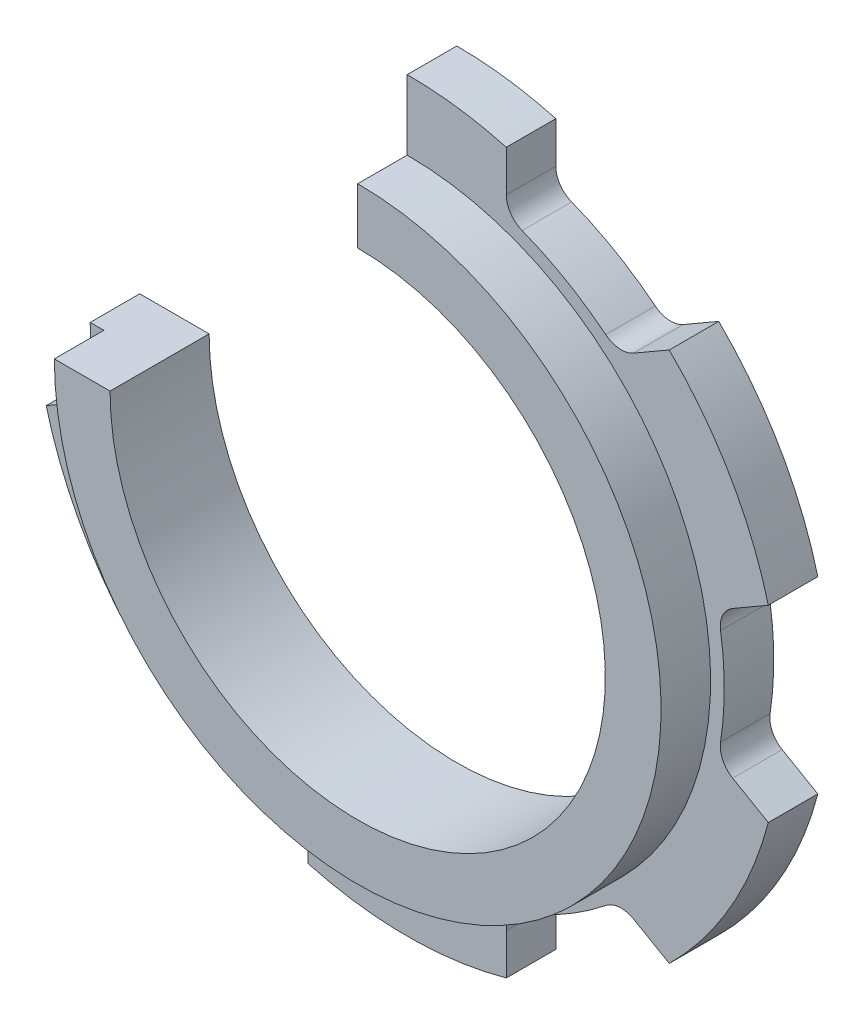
ISO-10303-21;
HEADER;
FILE_DESCRIPTION(('STEP AP214'),'2;1');
FILE_NAME('part.step','',(''),(''),'','','');
FILE_SCHEMA(('AUTOMOTIVE_DESIGN { 1 0 10303 214 1 1 1 1 }'));
ENDSEC;
DATA;
#1=APPLICATION_CONTEXT('core data for automotive mechanical design processes');
#2=APPLICATION_PROTOCOL_DEFINITION('international standard','automotive_design',2000,#1);
#3=PRODUCT_CONTEXT('',#1,'mechanical');
#4=PRODUCT('Part','Part','',(#3));
#5=PRODUCT_RELATED_PRODUCT_CATEGORY('part','',(#4));
#6=PRODUCT_DEFINITION_FORMATION('','',#4);
#7=PRODUCT_DEFINITION_CONTEXT('part definition',#1,'design');
#8=PRODUCT_DEFINITION('design','',#6,#7);
#9=PRODUCT_DEFINITION_SHAPE('','',#8);
#10=(LENGTH_UNIT() NAMED_UNIT(*) SI_UNIT(.MILLI.,.METRE.));
#11=(NAMED_UNIT(*) PLANE_ANGLE_UNIT() SI_UNIT($,.RADIAN.));
#12=(NAMED_UNIT(*) SI_UNIT($,.STERADIAN.) SOLID_ANGLE_UNIT());
#13=UNCERTAINTY_MEASURE_WITH_UNIT(LENGTH_MEASURE(1.E-05),#10,'distance_accuracy_value','');
#14=(GEOMETRIC_REPRESENTATION_CONTEXT(3) GLOBAL_UNCERTAINTY_ASSIGNED_CONTEXT((#13)) GLOBAL_UNIT_ASSIGNED_CONTEXT((#10,
#11,#12)) REPRESENTATION_CONTEXT('',''));
#15=CARTESIAN_POINT('',(0.,0.,0.));
#16=DIRECTION('',(0.,0.,1.));
#17=DIRECTION('',(1.,0.,0.));
#18=AXIS2_PLACEMENT_3D('',#15,#16,#17);
#19=CARTESIAN_POINT('',(0.,0.,-2.));
#20=DIRECTION('',(0.,0.,1.));
#21=DIRECTION('',(1.,0.,0.));
#22=AXIS2_PLACEMENT_3D('',#19,#20,#21);
#23=CYLINDRICAL_SURFACE('',#22,15.0665917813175);
#24=DIRECTION('',(0.,0.,1.));
#25=VECTOR('',#24,1.);
#26=CARTESIAN_POINT('',(0.,15.0665917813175,-2.));
#27=LINE('',#26,#25);
#28=CARTESIAN_POINT('',(0.,15.0665917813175,0.));
#29=VERTEX_POINT('',#28);
#30=CARTESIAN_POINT('',(0.,15.0665917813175,-2.));
#31=VERTEX_POINT('',#30);
#32=EDGE_CURVE('E11',#29,#31,#27,.F.);
#33=ORIENTED_EDGE('',*,*,#32,.F.);
#34=CARTESIAN_POINT('',(0.,0.,0.));
#35=DIRECTION('',(0.,0.,-1.));
#36=DIRECTION('',(-1.,0.,0.));
#37=AXIS2_PLACEMENT_3D('',#34,#35,#36);
#38=CIRCLE('',#37,15.0665917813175);
#39=CARTESIAN_POINT('',(4.,14.52591435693,0.));
#40=VERTEX_POINT('',#39);
#41=EDGE_CURVE('E451',#29,#40,#38,.T.);
#42=ORIENTED_EDGE('',*,*,#41,.T.);
#43=DIRECTION('',(0.,0.,1.));
#44=VECTOR('',#43,1.);
#45=CARTESIAN_POINT('',(4.,14.52591435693,-2.));
#46=LINE('',#45,#44);
#47=CARTESIAN_POINT('',(4.,14.52591435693,-2.));
#48=VERTEX_POINT('',#47);
#49=EDGE_CURVE('E341',#48,#40,#46,.T.);
#50=ORIENTED_EDGE('',*,*,#49,.F.);
#51=CARTESIAN_POINT('',(0.,0.,-2.));
#52=DIRECTION('',(0.,0.,-1.));
#53=DIRECTION('',(-1.,0.,0.));
#54=AXIS2_PLACEMENT_3D('',#51,#52,#53);
#55=CIRCLE('',#54,15.0665917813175);
#56=EDGE_CURVE('E263',#31,#48,#55,.T.);
#57=ORIENTED_EDGE('',*,*,#56,.F.);
#58=EDGE_LOOP('',(#33,#42,#50,#57));
#59=FACE_BOUND('',#58,.T.);
#60=ADVANCED_FACE('F30',(#59),#23,.T.);
#61=CARTESIAN_POINT('',(0.,0.,2.));
#62=DIRECTION('',(0.,0.,1.));
#63=DIRECTION('',(1.,0.,0.));
#64=AXIS2_PLACEMENT_3D('',#61,#62,#63);
#65=PLANE('',#64);
#66=DIRECTION('',(1.,0.,0.));
#67=VECTOR('',#66,1.);
#68=CARTESIAN_POINT('',(0.,0.,2.));
#69=LINE('',#68,#67);
#70=CARTESIAN_POINT('',(-12.25,0.,2.));
#71=VERTEX_POINT('',#70);
#72=CARTESIAN_POINT('',(-10.,0.,2.));
#73=VERTEX_POINT('',#72);
#74=EDGE_CURVE('E559',#71,#73,#69,.T.);
#75=ORIENTED_EDGE('',*,*,#74,.F.);
#76=CARTESIAN_POINT('',(0.,0.,2.));
#77=DIRECTION('',(0.,0.,1.));
#78=DIRECTION('',(1.,0.,0.));
#79=AXIS2_PLACEMENT_3D('',#76,#77,#78);
#80=CIRCLE('',#79,12.25);
#81=CARTESIAN_POINT('',(0.,12.25,2.));
#82=VERTEX_POINT('',#81);
#83=EDGE_CURVE('E348',#71,#82,#80,.T.);
#84=ORIENTED_EDGE('',*,*,#83,.T.);
#85=DIRECTION('',(0.,-1.,0.));
#86=VECTOR('',#85,1.);
#87=CARTESIAN_POINT('',(0.,0.,2.));
#88=LINE('',#87,#86);
#89=CARTESIAN_POINT('',(0.,10.,2.));
#90=VERTEX_POINT('',#89);
#91=EDGE_CURVE('E561',#82,#90,#88,.T.);
#92=ORIENTED_EDGE('',*,*,#91,.T.);
#93=CARTESIAN_POINT('',(0.,0.,2.));
#94=DIRECTION('',(0.,0.,1.));
#95=DIRECTION('',(1.,0.,0.));
#96=AXIS2_PLACEMENT_3D('',#93,#94,#95);
#97=CIRCLE('',#96,10.);
#98=EDGE_CURVE('E345',#73,#90,#97,.T.);
#99=ORIENTED_EDGE('',*,*,#98,.F.);
#100=EDGE_LOOP('',(#75,#84,#92,#99));
#101=FACE_BOUND('',#100,.T.);
#102=ADVANCED_FACE('F531',(#101),#65,.T.);
#103=CARTESIAN_POINT('',(0.,0.,2.));
#104=DIRECTION('',(0.,0.,-1.));
#105=DIRECTION('',(-1.,0.,0.));
#106=AXIS2_PLACEMENT_3D('',#103,#104,#105);
#107=CYLINDRICAL_SURFACE('',#106,12.25);
#108=ORIENTED_EDGE('',*,*,#83,.F.);
#109=DIRECTION('',(0.,0.,-1.));
#110=VECTOR('',#109,1.);
#111=CARTESIAN_POINT('',(-12.25,0.,2.));
#112=LINE('',#111,#110);
#113=CARTESIAN_POINT('',(-12.25,0.,0.));
#114=VERTEX_POINT('',#113);
#115=EDGE_CURVE('E555',#71,#114,#112,.T.);
#116=ORIENTED_EDGE('',*,*,#115,.T.);
#117=CARTESIAN_POINT('',(0.,0.,0.));
#118=DIRECTION('',(0.,0.,-1.));
#119=DIRECTION('',(-1.,0.,0.));
#120=AXIS2_PLACEMENT_3D('',#117,#118,#119);
#121=CIRCLE('',#120,12.25);
#122=CARTESIAN_POINT('',(0.,12.25,0.));
#123=VERTEX_POINT('',#122);
#124=EDGE_CURVE('E256',#123,#114,#121,.T.);
#125=ORIENTED_EDGE('',*,*,#124,.F.);
#126=DIRECTION('',(0.,0.,-1.));
#127=VECTOR('',#126,1.);
#128=CARTESIAN_POINT('',(0.,12.25,2.));
#129=LINE('',#128,#127);
#130=EDGE_CURVE('E563',#82,#123,#129,.T.);
#131=ORIENTED_EDGE('',*,*,#130,.F.);
#132=EDGE_LOOP('',(#108,#116,#125,#131));
#133=FACE_BOUND('',#132,.T.);
#134=ADVANCED_FACE('F32',(#133),#107,.T.);
#135=CARTESIAN_POINT('',(0.,0.,2.));
#136=DIRECTION('',(0.,0.,-1.));
#137=DIRECTION('',(-1.,0.,0.));
#138=AXIS2_PLACEMENT_3D('',#135,#136,#137);
#139=CYLINDRICAL_SURFACE('',#138,10.);
#140=DIRECTION('',(0.,0.,-1.));
#141=VECTOR('',#140,1.);
#142=CARTESIAN_POINT('',(-10.,0.,2.));
#143=LINE('',#142,#141);
#144=CARTESIAN_POINT('',(-9.99999999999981,0.,-2.));
#145=VERTEX_POINT('',#144);
#146=EDGE_CURVE('E257',#73,#145,#143,.T.);
#147=ORIENTED_EDGE('',*,*,#146,.F.);
#148=ORIENTED_EDGE('',*,*,#98,.T.);
#149=DIRECTION('',(0.,0.,-1.));
#150=VECTOR('',#149,1.);
#151=CARTESIAN_POINT('',(0.,10.,2.));
#152=LINE('',#151,#150);
#153=CARTESIAN_POINT('',(0.,10.0000000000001,-2.));
#154=VERTEX_POINT('',#153);
#155=EDGE_CURVE('E565',#90,#154,#152,.T.);
#156=ORIENTED_EDGE('',*,*,#155,.T.);
#157=CARTESIAN_POINT('',(0.,1.62351801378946E-13,-2.));
#158=DIRECTION('',(0.,0.,-1.));
#159=DIRECTION('',(-1.,0.,0.));
#160=AXIS2_PLACEMENT_3D('',#157,#158,#159);
#161=CIRCLE('',#160,9.9999999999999);
#162=EDGE_CURVE('E455',#154,#145,#161,.T.);
#163=ORIENTED_EDGE('',*,*,#162,.T.);
#164=EDGE_LOOP('',(#147,#148,#156,#163));
#165=FACE_BOUND('',#164,.T.);
#166=ADVANCED_FACE('F541',(#165),#139,.F.);
#167=CARTESIAN_POINT('',(0.,1.62351801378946E-13,0.));
#168=DIRECTION('',(0.,0.,-1.));
#169=DIRECTION('',(-1.,0.,0.));
#170=AXIS2_PLACEMENT_3D('',#167,#168,#169);
#171=PLANE('',#170);
#172=ORIENTED_EDGE('',*,*,#124,.T.);
#173=DIRECTION('',(-1.,0.,0.));
#174=VECTOR('',#173,1.);
#175=CARTESIAN_POINT('',(0.,0.,0.));
#176=LINE('',#175,#174);
#177=CARTESIAN_POINT('',(-12.8023679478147,0.,0.));
#178=VERTEX_POINT('',#177);
#179=EDGE_CURVE('E243',#114,#178,#176,.T.);
#180=ORIENTED_EDGE('',*,*,#179,.T.);
#181=CARTESIAN_POINT('',(0.,1.62351801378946E-13,0.));
#182=DIRECTION('',(0.,0.,-1.));
#183=DIRECTION('',(-1.,0.,0.));
#184=AXIS2_PLACEMENT_3D('',#181,#182,#183);
#185=CIRCLE('',#184,12.8023679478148);
#186=CARTESIAN_POINT('',(-12.6529885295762,-1.95000162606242,0.));
#187=VERTEX_POINT('',#186);
#188=EDGE_CURVE('E254',#187,#178,#185,.T.);
#189=ORIENTED_EDGE('',*,*,#188,.F.);
#190=CARTESIAN_POINT('',(-13.6413204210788,-2.10231732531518,0.));
#191=DIRECTION('',(0.,0.,-1.));
#192=DIRECTION('',(-1.,0.,0.));
#193=AXIS2_PLACEMENT_3D('',#190,#191,#192);
#194=CIRCLE('',#193,1.);
#195=CARTESIAN_POINT('',(-13.1413204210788,-2.96834272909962,0.));
#196=VERTEX_POINT('',#195);
#197=EDGE_CURVE('E414',#187,#196,#194,.T.);
#198=ORIENTED_EDGE('',*,*,#197,.T.);
#199=DIRECTION('',(0.866025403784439,0.5,0.));
#200=VECTOR('',#199,1.);
#201=CARTESIAN_POINT('',(-14.5798108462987,-3.79885556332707,0.));
#202=LINE('',#201,#200);
#203=CARTESIAN_POINT('',(-14.5798108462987,-3.79885556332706,0.));
#204=VERTEX_POINT('',#203);
#205=EDGE_CURVE('E264',#204,#196,#202,.T.);
#206=ORIENTED_EDGE('',*,*,#205,.F.);
#207=CARTESIAN_POINT('',(0.,0.,0.));
#208=DIRECTION('',(0.,0.,-1.));
#209=DIRECTION('',(-1.,0.,0.));
#210=AXIS2_PLACEMENT_3D('',#207,#208,#209);
#211=CIRCLE('',#210,15.0665917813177);
#212=CARTESIAN_POINT('',(-10.5798108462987,-10.7270587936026,0.));
#213=VERTEX_POINT('',#212);
#214=EDGE_CURVE('E269',#213,#204,#211,.T.);
#215=ORIENTED_EDGE('',*,*,#214,.F.);
#216=DIRECTION('',(-0.866025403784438,-0.5,0.));
#217=VECTOR('',#216,1.);
#218=CARTESIAN_POINT('',(-10.5798108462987,-10.7270587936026,0.));
#219=LINE('',#218,#217);
#220=CARTESIAN_POINT('',(-9.14132042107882,-9.89654595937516,0.));
#221=VERTEX_POINT('',#220);
#222=EDGE_CURVE('E488',#221,#213,#219,.T.);
#223=ORIENTED_EDGE('',*,*,#222,.F.);
#224=CARTESIAN_POINT('',(-8.64132042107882,-10.7625713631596,0.));
#225=DIRECTION('',(0.,0.,-1.));
#226=DIRECTION('',(-1.,0.,0.));
#227=AXIS2_PLACEMENT_3D('',#224,#225,#226);
#228=CIRCLE('',#227,1.);
#229=CARTESIAN_POINT('',(-8.0152452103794,-9.9828086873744,0.));
#230=VERTEX_POINT('',#229);
#231=EDGE_CURVE('E406',#221,#230,#228,.T.);
#232=ORIENTED_EDGE('',*,*,#231,.T.);
#233=CARTESIAN_POINT('',(0.,1.62351801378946E-13,0.));
#234=DIRECTION('',(0.,0.,-1.));
#235=DIRECTION('',(-1.,0.,0.));
#236=AXIS2_PLACEMENT_3D('',#233,#234,#235);
#237=CIRCLE('',#236,12.8023679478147);
#238=CARTESIAN_POINT('',(-4.63774331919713,-11.9328103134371,0.));
#239=VERTEX_POINT('',#238);
#240=EDGE_CURVE('E485',#239,#230,#237,.T.);
#241=ORIENTED_EDGE('',*,*,#240,.F.);
#242=CARTESIAN_POINT('',(-5.00000000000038,-12.864888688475,0.));
#243=DIRECTION('',(0.,0.,-1.));
#244=DIRECTION('',(-1.,0.,0.));
#245=AXIS2_PLACEMENT_3D('',#242,#243,#244);
#246=CIRCLE('',#245,1.);
#247=CARTESIAN_POINT('',(-4.00000000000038,-12.864888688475,0.));
#248=VERTEX_POINT('',#247);
#249=EDGE_CURVE('E410',#239,#248,#246,.T.);
#250=ORIENTED_EDGE('',*,*,#249,.T.);
#251=DIRECTION('',(0.,1.,0.));
#252=VECTOR('',#251,1.);
#253=CARTESIAN_POINT('',(-4.00000000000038,-14.52591435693,0.));
#254=LINE('',#253,#252);
#255=CARTESIAN_POINT('',(-4.00000000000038,-14.52591435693,0.));
#256=VERTEX_POINT('',#255);
#257=EDGE_CURVE('E482',#256,#248,#254,.T.);
#258=ORIENTED_EDGE('',*,*,#257,.F.);
#259=CARTESIAN_POINT('',(-3.74935424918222E-13,0.,0.));
#260=DIRECTION('',(0.,0.,-1.));
#261=DIRECTION('',(-1.,0.,0.));
#262=AXIS2_PLACEMENT_3D('',#259,#260,#261);
#263=CIRCLE('',#262,15.0665917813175);
#264=CARTESIAN_POINT('',(3.99999999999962,-14.52591435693,0.));
#265=VERTEX_POINT('',#264);
#266=EDGE_CURVE('E480',#265,#256,#263,.T.);
#267=ORIENTED_EDGE('',*,*,#266,.F.);
#268=DIRECTION('',(0.,-1.,0.));
#269=VECTOR('',#268,1.);
#270=CARTESIAN_POINT('',(3.99999999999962,-14.52591435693,0.));
#271=LINE('',#270,#269);
#272=CARTESIAN_POINT('',(3.99999999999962,-12.8648886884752,0.));
#273=VERTEX_POINT('',#272);
#274=EDGE_CURVE('E478',#273,#265,#271,.T.);
#275=ORIENTED_EDGE('',*,*,#274,.F.);
#276=CARTESIAN_POINT('',(4.99999999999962,-12.8648886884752,0.));
#277=DIRECTION('',(0.,0.,-1.));
#278=DIRECTION('',(-1.,0.,0.));
#279=AXIS2_PLACEMENT_3D('',#276,#277,#278);
#280=CIRCLE('',#279,1.);
#281=CARTESIAN_POINT('',(4.63774331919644,-11.9328103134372,0.));
#282=VERTEX_POINT('',#281);
#283=EDGE_CURVE('E398',#273,#282,#280,.T.);
#284=ORIENTED_EDGE('',*,*,#283,.T.);
#285=CARTESIAN_POINT('',(0.,1.62351801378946E-13,0.));
#286=DIRECTION('',(0.,0.,-1.));
#287=DIRECTION('',(-1.,0.,0.));
#288=AXIS2_PLACEMENT_3D('',#285,#286,#287);
#289=CIRCLE('',#288,12.8023679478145);
#290=CARTESIAN_POINT('',(8.01524521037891,-9.98280868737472,0.));
#291=VERTEX_POINT('',#290);
#292=EDGE_CURVE('E475',#291,#282,#289,.T.);
#293=ORIENTED_EDGE('',*,*,#292,.F.);
#294=CARTESIAN_POINT('',(8.64132042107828,-10.7625713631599,0.));
#295=DIRECTION('',(0.,0.,-1.));
#296=DIRECTION('',(-1.,0.,0.));
#297=AXIS2_PLACEMENT_3D('',#294,#295,#296);
#298=CIRCLE('',#297,1.);
#299=CARTESIAN_POINT('',(9.14132042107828,-9.8965459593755,0.));
#300=VERTEX_POINT('',#299);
#301=EDGE_CURVE('E402',#291,#300,#298,.T.);
#302=ORIENTED_EDGE('',*,*,#301,.T.);
#303=DIRECTION('',(-0.866025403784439,0.499999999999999,0.));
#304=VECTOR('',#303,1.);
#305=CARTESIAN_POINT('',(10.5798108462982,-10.7270587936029,0.));
#306=LINE('',#305,#304);
#307=CARTESIAN_POINT('',(10.5798108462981,-10.7270587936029,0.));
#308=VERTEX_POINT('',#307);
#309=EDGE_CURVE('E472',#308,#300,#306,.T.);
#310=ORIENTED_EDGE('',*,*,#309,.F.);
#311=CARTESIAN_POINT('',(0.,0.,0.));
#312=DIRECTION('',(0.,0.,-1.));
#313=DIRECTION('',(-1.,0.,0.));
#314=AXIS2_PLACEMENT_3D('',#311,#312,#313);
#315=CIRCLE('',#314,15.0665917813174);
#316=CARTESIAN_POINT('',(14.5798108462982,-3.7988555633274,0.));
#317=VERTEX_POINT('',#316);
#318=EDGE_CURVE('E470',#317,#308,#315,.T.);
#319=ORIENTED_EDGE('',*,*,#318,.F.);
#320=DIRECTION('',(0.866025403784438,-0.5,0.));
#321=VECTOR('',#320,1.);
#322=CARTESIAN_POINT('',(14.5798108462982,-3.7988555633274,0.));
#323=LINE('',#322,#321);
#324=CARTESIAN_POINT('',(13.1413204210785,-2.96834272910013,0.));
#325=VERTEX_POINT('',#324);
#326=EDGE_CURVE('E468',#325,#317,#323,.T.);
#327=ORIENTED_EDGE('',*,*,#326,.F.);
#328=CARTESIAN_POINT('',(13.6413204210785,-2.10231732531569,0.));
#329=DIRECTION('',(0.,0.,-1.));
#330=DIRECTION('',(-1.,0.,0.));
#331=AXIS2_PLACEMENT_3D('',#328,#329,#330);
#332=CIRCLE('',#331,1.);
#333=CARTESIAN_POINT('',(12.6529885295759,-1.95000162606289,0.));
#334=VERTEX_POINT('',#333);
#335=EDGE_CURVE('E418',#325,#334,#332,.T.);
#336=ORIENTED_EDGE('',*,*,#335,.T.);
#337=CARTESIAN_POINT('',(0.,1.62351801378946E-13,0.));
#338=DIRECTION('',(0.,0.,-1.));
#339=DIRECTION('',(-1.,0.,0.));
#340=AXIS2_PLACEMENT_3D('',#337,#338,#339);
#341=CIRCLE('',#340,12.8023679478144);
#342=CARTESIAN_POINT('',(12.652988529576,1.95000162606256,0.));
#343=VERTEX_POINT('',#342);
#344=EDGE_CURVE('E465',#343,#334,#341,.T.);
#345=ORIENTED_EDGE('',*,*,#344,.F.);
#346=CARTESIAN_POINT('',(13.6413204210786,2.10231732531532,0.));
#347=DIRECTION('',(0.,0.,-1.));
#348=DIRECTION('',(-1.,0.,0.));
#349=AXIS2_PLACEMENT_3D('',#346,#347,#348);
#350=CIRCLE('',#349,1.);
#351=CARTESIAN_POINT('',(13.1413204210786,2.96834272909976,0.));
#352=VERTEX_POINT('',#351);
#353=EDGE_CURVE('E394',#343,#352,#350,.T.);
#354=ORIENTED_EDGE('',*,*,#353,.T.);
#355=DIRECTION('',(-0.86602540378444,-0.499999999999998,0.));
#356=VECTOR('',#355,1.);
#357=CARTESIAN_POINT('',(14.5798108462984,3.79885556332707,0.));
#358=LINE('',#357,#356);
#359=CARTESIAN_POINT('',(14.5798108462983,3.79885556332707,0.));
#360=VERTEX_POINT('',#359);
#361=EDGE_CURVE('E462',#360,#352,#358,.T.);
#362=ORIENTED_EDGE('',*,*,#361,.F.);
#363=CARTESIAN_POINT('',(0.,0.,0.));
#364=DIRECTION('',(0.,0.,-1.));
#365=DIRECTION('',(-1.,0.,0.));
#366=AXIS2_PLACEMENT_3D('',#363,#364,#365);
#367=CIRCLE('',#366,15.0665917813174);
#368=CARTESIAN_POINT('',(10.5798108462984,10.7270587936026,0.));
#369=VERTEX_POINT('',#368);
#370=EDGE_CURVE('E460',#369,#360,#367,.T.);
#371=ORIENTED_EDGE('',*,*,#370,.F.);
#372=DIRECTION('',(0.866025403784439,0.5,0.));
#373=VECTOR('',#372,1.);
#374=CARTESIAN_POINT('',(10.5798108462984,10.7270587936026,0.));
#375=LINE('',#374,#373);
#376=CARTESIAN_POINT('',(9.14132042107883,9.89654595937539,0.));
#377=VERTEX_POINT('',#376);
#378=EDGE_CURVE('E453',#377,#369,#375,.T.);
#379=ORIENTED_EDGE('',*,*,#378,.F.);
#380=CARTESIAN_POINT('',(8.64132042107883,10.7625713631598,0.));
#381=DIRECTION('',(0.,0.,-1.));
#382=DIRECTION('',(-1.,0.,0.));
#383=AXIS2_PLACEMENT_3D('',#380,#381,#382);
#384=CIRCLE('',#383,1.);
#385=CARTESIAN_POINT('',(8.01524521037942,9.98280868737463,0.));
#386=VERTEX_POINT('',#385);
#387=EDGE_CURVE('E422',#377,#386,#384,.T.);
#388=ORIENTED_EDGE('',*,*,#387,.T.);
#389=CARTESIAN_POINT('',(0.,1.62351801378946E-13,0.));
#390=DIRECTION('',(0.,0.,-1.));
#391=DIRECTION('',(-1.,0.,0.));
#392=AXIS2_PLACEMENT_3D('',#389,#390,#391);
#393=CIRCLE('',#392,12.8023679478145);
#394=CARTESIAN_POINT('',(4.63774331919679,11.9328103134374,0.));
#395=VERTEX_POINT('',#394);
#396=EDGE_CURVE('E447',#395,#386,#393,.T.);
#397=ORIENTED_EDGE('',*,*,#396,.F.);
#398=CARTESIAN_POINT('',(5.,12.8648886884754,0.));
#399=DIRECTION('',(0.,0.,-1.));
#400=DIRECTION('',(-1.,0.,0.));
#401=AXIS2_PLACEMENT_3D('',#398,#399,#400);
#402=CIRCLE('',#401,1.);
#403=CARTESIAN_POINT('',(4.,12.8648886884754,0.));
#404=VERTEX_POINT('',#403);
#405=EDGE_CURVE('E426',#395,#404,#402,.T.);
#406=ORIENTED_EDGE('',*,*,#405,.T.);
#407=DIRECTION('',(0.,-1.,0.));
#408=VECTOR('',#407,1.);
#409=CARTESIAN_POINT('',(4.,14.52591435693,0.));
#410=LINE('',#409,#408);
#411=EDGE_CURVE('E446',#40,#404,#410,.T.);
#412=ORIENTED_EDGE('',*,*,#411,.F.);
#413=ORIENTED_EDGE('',*,*,#41,.F.);
#414=DIRECTION('',(0.,1.,0.));
#415=VECTOR('',#414,1.);
#416=CARTESIAN_POINT('',(0.,1.62351801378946E-13,0.));
#417=LINE('',#416,#415);
#418=EDGE_CURVE('E44',#123,#29,#417,.T.);
#419=ORIENTED_EDGE('',*,*,#418,.F.);
#420=EDGE_LOOP('',(#172,#180,#189,#198,#206,#215,#223,#232,#241,#250,#258,#267,#275,#284,#293,
#302,#310,#319,#327,#336,#345,#354,#362,#371,#379,#388,#397,#406,#412,#413,#419));
#421=FACE_BOUND('',#420,.T.);
#422=ADVANCED_FACE('F253',(#421),#171,.F.);
#423=CARTESIAN_POINT('',(0.,1.62351801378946E-13,-2.));
#424=DIRECTION('',(0.,0.,-1.));
#425=DIRECTION('',(-1.,0.,0.));
#426=AXIS2_PLACEMENT_3D('',#423,#424,#425);
#427=PLANE('',#426);
#428=DIRECTION('',(-1.,0.,0.));
#429=VECTOR('',#428,1.);
#430=CARTESIAN_POINT('',(0.,0.,-2.));
#431=LINE('',#430,#429);
#432=CARTESIAN_POINT('',(-12.8023679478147,0.,-2.));
#433=VERTEX_POINT('',#432);
#434=EDGE_CURVE('E52',#145,#433,#431,.T.);
#435=ORIENTED_EDGE('',*,*,#434,.F.);
#436=ORIENTED_EDGE('',*,*,#162,.F.);
#437=DIRECTION('',(0.,1.,0.));
#438=VECTOR('',#437,1.);
#439=CARTESIAN_POINT('',(0.,1.62351801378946E-13,-2.));
#440=LINE('',#439,#438);
#441=EDGE_CURVE('E570',#154,#31,#440,.T.);
#442=ORIENTED_EDGE('',*,*,#441,.T.);
#443=ORIENTED_EDGE('',*,*,#56,.T.);
#444=DIRECTION('',(0.,-1.,0.));
#445=VECTOR('',#444,1.);
#446=CARTESIAN_POINT('',(4.,14.52591435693,-2.));
#447=LINE('',#446,#445);
#448=CARTESIAN_POINT('',(4.,12.8648886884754,-2.));
#449=VERTEX_POINT('',#448);
#450=EDGE_CURVE('E266',#48,#449,#447,.T.);
#451=ORIENTED_EDGE('',*,*,#450,.T.);
#452=CARTESIAN_POINT('',(5.,12.8648886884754,-2.));
#453=DIRECTION('',(0.,0.,-1.));
#454=DIRECTION('',(-1.,0.,0.));
#455=AXIS2_PLACEMENT_3D('',#452,#453,#454);
#456=CIRCLE('',#455,1.);
#457=CARTESIAN_POINT('',(4.63774331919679,11.9328103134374,-2.));
#458=VERTEX_POINT('',#457);
#459=EDGE_CURVE('E249',#449,#458,#456,.F.);
#460=ORIENTED_EDGE('',*,*,#459,.T.);
#461=CARTESIAN_POINT('',(0.,1.62351801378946E-13,-2.));
#462=DIRECTION('',(0.,0.,-1.));
#463=DIRECTION('',(-1.,0.,0.));
#464=AXIS2_PLACEMENT_3D('',#461,#462,#463);
#465=CIRCLE('',#464,12.8023679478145);
#466=CARTESIAN_POINT('',(8.01524521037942,9.98280868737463,-2.));
#467=VERTEX_POINT('',#466);
#468=EDGE_CURVE('E275',#458,#467,#465,.T.);
#469=ORIENTED_EDGE('',*,*,#468,.T.);
#470=CARTESIAN_POINT('',(8.64132042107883,10.7625713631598,-2.));
#471=DIRECTION('',(0.,0.,-1.));
#472=DIRECTION('',(-1.,0.,0.));
#473=AXIS2_PLACEMENT_3D('',#470,#471,#472);
#474=CIRCLE('',#473,1.);
#475=CARTESIAN_POINT('',(9.14132042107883,9.89654595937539,-2.));
#476=VERTEX_POINT('',#475);
#477=EDGE_CURVE('E424',#467,#476,#474,.F.);
#478=ORIENTED_EDGE('',*,*,#477,.T.);
#479=DIRECTION('',(0.866025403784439,0.5,0.));
#480=VECTOR('',#479,1.);
#481=CARTESIAN_POINT('',(10.5798108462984,10.7270587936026,-2.));
#482=LINE('',#481,#480);
#483=CARTESIAN_POINT('',(10.5798108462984,10.7270587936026,-2.));
#484=VERTEX_POINT('',#483);
#485=EDGE_CURVE('E278',#476,#484,#482,.T.);
#486=ORIENTED_EDGE('',*,*,#485,.T.);
#487=CARTESIAN_POINT('',(0.,0.,-2.));
#488=DIRECTION('',(0.,0.,-1.));
#489=DIRECTION('',(-1.,0.,0.));
#490=AXIS2_PLACEMENT_3D('',#487,#488,#489);
#491=CIRCLE('',#490,15.0665917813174);
#492=CARTESIAN_POINT('',(14.5798108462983,3.79885556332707,-2.));
#493=VERTEX_POINT('',#492);
#494=EDGE_CURVE('E280',#484,#493,#491,.T.);
#495=ORIENTED_EDGE('',*,*,#494,.T.);
#496=DIRECTION('',(-0.86602540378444,-0.499999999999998,0.));
#497=VECTOR('',#496,1.);
#498=CARTESIAN_POINT('',(14.5798108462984,3.79885556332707,-2.));
#499=LINE('',#498,#497);
#500=CARTESIAN_POINT('',(13.1413204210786,2.96834272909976,-2.));
#501=VERTEX_POINT('',#500);
#502=EDGE_CURVE('E282',#493,#501,#499,.T.);
#503=ORIENTED_EDGE('',*,*,#502,.T.);
#504=CARTESIAN_POINT('',(13.6413204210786,2.10231732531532,-2.));
#505=DIRECTION('',(0.,0.,-1.));
#506=DIRECTION('',(-1.,0.,0.));
#507=AXIS2_PLACEMENT_3D('',#504,#505,#506);
#508=CIRCLE('',#507,1.);
#509=CARTESIAN_POINT('',(12.652988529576,1.95000162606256,-2.));
#510=VERTEX_POINT('',#509);
#511=EDGE_CURVE('E396',#501,#510,#508,.F.);
#512=ORIENTED_EDGE('',*,*,#511,.T.);
#513=CARTESIAN_POINT('',(0.,1.62351801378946E-13,-2.));
#514=DIRECTION('',(0.,0.,-1.));
#515=DIRECTION('',(-1.,0.,0.));
#516=AXIS2_PLACEMENT_3D('',#513,#514,#515);
#517=CIRCLE('',#516,12.8023679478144);
#518=CARTESIAN_POINT('',(12.6529885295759,-1.95000162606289,-2.));
#519=VERTEX_POINT('',#518);
#520=EDGE_CURVE('E285',#510,#519,#517,.T.);
#521=ORIENTED_EDGE('',*,*,#520,.T.);
#522=CARTESIAN_POINT('',(13.6413204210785,-2.10231732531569,-2.));
#523=DIRECTION('',(0.,0.,-1.));
#524=DIRECTION('',(-1.,0.,0.));
#525=AXIS2_PLACEMENT_3D('',#522,#523,#524);
#526=CIRCLE('',#525,1.);
#527=CARTESIAN_POINT('',(13.1413204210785,-2.96834272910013,-2.));
#528=VERTEX_POINT('',#527);
#529=EDGE_CURVE('E420',#519,#528,#526,.F.);
#530=ORIENTED_EDGE('',*,*,#529,.T.);
#531=DIRECTION('',(0.866025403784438,-0.5,0.));
#532=VECTOR('',#531,1.);
#533=CARTESIAN_POINT('',(14.5798108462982,-3.7988555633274,-2.));
#534=LINE('',#533,#532);
#535=CARTESIAN_POINT('',(14.5798108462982,-3.7988555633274,-2.));
#536=VERTEX_POINT('',#535);
#537=EDGE_CURVE('E288',#528,#536,#534,.T.);
#538=ORIENTED_EDGE('',*,*,#537,.T.);
#539=CARTESIAN_POINT('',(0.,0.,-2.));
#540=DIRECTION('',(0.,0.,-1.));
#541=DIRECTION('',(-1.,0.,0.));
#542=AXIS2_PLACEMENT_3D('',#539,#540,#541);
#543=CIRCLE('',#542,15.0665917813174);
#544=CARTESIAN_POINT('',(10.5798108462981,-10.7270587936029,-2.));
#545=VERTEX_POINT('',#544);
#546=EDGE_CURVE('E290',#536,#545,#543,.T.);
#547=ORIENTED_EDGE('',*,*,#546,.T.);
#548=DIRECTION('',(-0.866025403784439,0.499999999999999,0.));
#549=VECTOR('',#548,1.);
#550=CARTESIAN_POINT('',(10.5798108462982,-10.7270587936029,-2.));
#551=LINE('',#550,#549);
#552=CARTESIAN_POINT('',(9.14132042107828,-9.8965459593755,-2.));
#553=VERTEX_POINT('',#552);
#554=EDGE_CURVE('E292',#545,#553,#551,.T.);
#555=ORIENTED_EDGE('',*,*,#554,.T.);
#556=CARTESIAN_POINT('',(8.64132042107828,-10.7625713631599,-2.));
#557=DIRECTION('',(0.,0.,-1.));
#558=DIRECTION('',(-1.,0.,0.));
#559=AXIS2_PLACEMENT_3D('',#556,#557,#558);
#560=CIRCLE('',#559,1.);
#561=CARTESIAN_POINT('',(8.01524521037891,-9.98280868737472,-2.));
#562=VERTEX_POINT('',#561);
#563=EDGE_CURVE('E404',#553,#562,#560,.F.);
#564=ORIENTED_EDGE('',*,*,#563,.T.);
#565=CARTESIAN_POINT('',(0.,1.62351801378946E-13,-2.));
#566=DIRECTION('',(0.,0.,-1.));
#567=DIRECTION('',(-1.,0.,0.));
#568=AXIS2_PLACEMENT_3D('',#565,#566,#567);
#569=CIRCLE('',#568,12.8023679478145);
#570=CARTESIAN_POINT('',(4.63774331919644,-11.9328103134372,-2.));
#571=VERTEX_POINT('',#570);
#572=EDGE_CURVE('E295',#562,#571,#569,.T.);
#573=ORIENTED_EDGE('',*,*,#572,.T.);
#574=CARTESIAN_POINT('',(4.99999999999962,-12.8648886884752,-2.));
#575=DIRECTION('',(0.,0.,-1.));
#576=DIRECTION('',(-1.,0.,0.));
#577=AXIS2_PLACEMENT_3D('',#574,#575,#576);
#578=CIRCLE('',#577,1.);
#579=CARTESIAN_POINT('',(3.99999999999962,-12.8648886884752,-2.));
#580=VERTEX_POINT('',#579);
#581=EDGE_CURVE('E400',#571,#580,#578,.F.);
#582=ORIENTED_EDGE('',*,*,#581,.T.);
#583=DIRECTION('',(0.,-1.,0.));
#584=VECTOR('',#583,1.);
#585=CARTESIAN_POINT('',(3.99999999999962,-14.52591435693,-2.));
#586=LINE('',#585,#584);
#587=CARTESIAN_POINT('',(3.99999999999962,-14.52591435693,-2.));
#588=VERTEX_POINT('',#587);
#589=EDGE_CURVE('E298',#580,#588,#586,.T.);
#590=ORIENTED_EDGE('',*,*,#589,.T.);
#591=CARTESIAN_POINT('',(-3.74935424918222E-13,0.,-2.));
#592=DIRECTION('',(0.,0.,-1.));
#593=DIRECTION('',(-1.,0.,0.));
#594=AXIS2_PLACEMENT_3D('',#591,#592,#593);
#595=CIRCLE('',#594,15.0665917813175);
#596=CARTESIAN_POINT('',(-4.00000000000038,-14.52591435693,-2.));
#597=VERTEX_POINT('',#596);
#598=EDGE_CURVE('E300',#588,#597,#595,.T.);
#599=ORIENTED_EDGE('',*,*,#598,.T.);
#600=DIRECTION('',(0.,1.,0.));
#601=VECTOR('',#600,1.);
#602=CARTESIAN_POINT('',(-4.00000000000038,-14.52591435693,-2.));
#603=LINE('',#602,#601);
#604=CARTESIAN_POINT('',(-4.00000000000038,-12.864888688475,-2.));
#605=VERTEX_POINT('',#604);
#606=EDGE_CURVE('E302',#597,#605,#603,.T.);
#607=ORIENTED_EDGE('',*,*,#606,.T.);
#608=CARTESIAN_POINT('',(-5.00000000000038,-12.864888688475,-2.));
#609=DIRECTION('',(0.,0.,-1.));
#610=DIRECTION('',(-1.,0.,0.));
#611=AXIS2_PLACEMENT_3D('',#608,#609,#610);
#612=CIRCLE('',#611,1.);
#613=CARTESIAN_POINT('',(-4.63774331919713,-11.9328103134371,-2.));
#614=VERTEX_POINT('',#613);
#615=EDGE_CURVE('E412',#605,#614,#612,.F.);
#616=ORIENTED_EDGE('',*,*,#615,.T.);
#617=CARTESIAN_POINT('',(0.,1.62351801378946E-13,-2.));
#618=DIRECTION('',(0.,0.,-1.));
#619=DIRECTION('',(-1.,0.,0.));
#620=AXIS2_PLACEMENT_3D('',#617,#618,#619);
#621=CIRCLE('',#620,12.8023679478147);
#622=CARTESIAN_POINT('',(-8.0152452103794,-9.9828086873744,-2.));
#623=VERTEX_POINT('',#622);
#624=EDGE_CURVE('E305',#614,#623,#621,.T.);
#625=ORIENTED_EDGE('',*,*,#624,.T.);
#626=CARTESIAN_POINT('',(-8.64132042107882,-10.7625713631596,-2.));
#627=DIRECTION('',(0.,0.,-1.));
#628=DIRECTION('',(-1.,0.,0.));
#629=AXIS2_PLACEMENT_3D('',#626,#627,#628);
#630=CIRCLE('',#629,1.);
#631=CARTESIAN_POINT('',(-9.14132042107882,-9.89654595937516,-2.));
#632=VERTEX_POINT('',#631);
#633=EDGE_CURVE('E408',#623,#632,#630,.F.);
#634=ORIENTED_EDGE('',*,*,#633,.T.);
#635=DIRECTION('',(-0.866025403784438,-0.5,0.));
#636=VECTOR('',#635,1.);
#637=CARTESIAN_POINT('',(-10.5798108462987,-10.7270587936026,-2.));
#638=LINE('',#637,#636);
#639=CARTESIAN_POINT('',(-10.5798108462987,-10.7270587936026,-2.));
#640=VERTEX_POINT('',#639);
#641=EDGE_CURVE('E308',#632,#640,#638,.T.);
#642=ORIENTED_EDGE('',*,*,#641,.T.);
#643=CARTESIAN_POINT('',(0.,0.,-2.));
#644=DIRECTION('',(0.,0.,-1.));
#645=DIRECTION('',(-1.,0.,0.));
#646=AXIS2_PLACEMENT_3D('',#643,#644,#645);
#647=CIRCLE('',#646,15.0665917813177);
#648=CARTESIAN_POINT('',(-14.5798108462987,-3.79885556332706,-2.));
#649=VERTEX_POINT('',#648);
#650=EDGE_CURVE('E310',#640,#649,#647,.T.);
#651=ORIENTED_EDGE('',*,*,#650,.T.);
#652=DIRECTION('',(0.866025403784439,0.5,0.));
#653=VECTOR('',#652,1.);
#654=CARTESIAN_POINT('',(-14.5798108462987,-3.79885556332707,-2.));
#655=LINE('',#654,#653);
#656=CARTESIAN_POINT('',(-13.1413204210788,-2.96834272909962,-2.));
#657=VERTEX_POINT('',#656);
#658=EDGE_CURVE('E312',#649,#657,#655,.T.);
#659=ORIENTED_EDGE('',*,*,#658,.T.);
#660=CARTESIAN_POINT('',(-13.6413204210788,-2.10231732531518,-2.));
#661=DIRECTION('',(0.,0.,-1.));
#662=DIRECTION('',(-1.,0.,0.));
#663=AXIS2_PLACEMENT_3D('',#660,#661,#662);
#664=CIRCLE('',#663,1.);
#665=CARTESIAN_POINT('',(-12.6529885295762,-1.95000162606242,-2.));
#666=VERTEX_POINT('',#665);
#667=EDGE_CURVE('E416',#657,#666,#664,.F.);
#668=ORIENTED_EDGE('',*,*,#667,.T.);
#669=CARTESIAN_POINT('',(0.,1.62351801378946E-13,-2.));
#670=DIRECTION('',(0.,0.,-1.));
#671=DIRECTION('',(-1.,0.,0.));
#672=AXIS2_PLACEMENT_3D('',#669,#670,#671);
#673=CIRCLE('',#672,12.8023679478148);
#674=EDGE_CURVE('E315',#666,#433,#673,.T.);
#675=ORIENTED_EDGE('',*,*,#674,.T.);
#676=EDGE_LOOP('',(#435,#436,#442,#443,#451,#460,#469,#478,#486,#495,#503,#512,#521,#530,#538,
#547,#555,#564,#573,#582,#590,#599,#607,#616,#625,#634,#642,#651,#659,#668,#675));
#677=FACE_BOUND('',#676,.T.);
#678=ADVANCED_FACE('F431',(#677),#427,.T.);
#679=CARTESIAN_POINT('',(4.,14.52591435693,-2.));
#680=DIRECTION('',(-1.,0.,0.));
#681=DIRECTION('',(0.,0.,1.));
#682=AXIS2_PLACEMENT_3D('',#679,#680,#681);
#683=PLANE('',#682);
#684=ORIENTED_EDGE('',*,*,#411,.T.);
#685=DIRECTION('',(0.,0.,-1.));
#686=VECTOR('',#685,1.);
#687=CARTESIAN_POINT('',(4.,12.8648886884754,-2.));
#688=LINE('',#687,#686);
#689=EDGE_CURVE('E392',#404,#449,#688,.T.);
#690=ORIENTED_EDGE('',*,*,#689,.T.);
#691=ORIENTED_EDGE('',*,*,#450,.F.);
#692=ORIENTED_EDGE('',*,*,#49,.T.);
#693=EDGE_LOOP('',(#684,#690,#691,#692));
#694=FACE_BOUND('',#693,.T.);
#695=ADVANCED_FACE('F449',(#694),#683,.F.);
#696=CARTESIAN_POINT('',(0.,1.62351801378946E-13,-2.));
#697=DIRECTION('',(0.,0.,1.));
#698=DIRECTION('',(1.,0.,0.));
#699=AXIS2_PLACEMENT_3D('',#696,#697,#698);
#700=CYLINDRICAL_SURFACE('',#699,12.8023679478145);
#701=ORIENTED_EDGE('',*,*,#396,.T.);
#702=DIRECTION('',(0.,0.,1.));
#703=VECTOR('',#702,1.);
#704=CARTESIAN_POINT('',(8.01524521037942,9.98280868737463,-2.));
#705=LINE('',#704,#703);
#706=EDGE_CURVE('E390',#386,#467,#705,.F.);
#707=ORIENTED_EDGE('',*,*,#706,.T.);
#708=ORIENTED_EDGE('',*,*,#468,.F.);
#709=DIRECTION('',(0.,0.,1.));
#710=VECTOR('',#709,1.);
#711=CARTESIAN_POINT('',(4.63774331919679,11.9328103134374,-2.));
#712=LINE('',#711,#710);
#713=EDGE_CURVE('E387',#458,#395,#712,.T.);
#714=ORIENTED_EDGE('',*,*,#713,.T.);
#715=EDGE_LOOP('',(#701,#707,#708,#714));
#716=FACE_BOUND('',#715,.T.);
#717=ADVANCED_FACE('F439',(#716),#700,.T.);
#718=CARTESIAN_POINT('',(10.5798108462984,10.7270587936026,-2.));
#719=DIRECTION('',(0.5,-0.866025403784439,0.));
#720=DIRECTION('',(0.866025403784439,0.5,0.));
#721=AXIS2_PLACEMENT_3D('',#718,#719,#720);
#722=PLANE('',#721);
#723=ORIENTED_EDGE('',*,*,#485,.F.);
#724=DIRECTION('',(0.,0.,-1.));
#725=VECTOR('',#724,1.);
#726=CARTESIAN_POINT('',(9.14132042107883,9.89654595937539,0.));
#727=LINE('',#726,#725);
#728=EDGE_CURVE('E384',#476,#377,#727,.F.);
#729=ORIENTED_EDGE('',*,*,#728,.T.);
#730=ORIENTED_EDGE('',*,*,#378,.T.);
#731=DIRECTION('',(0.,0.,1.));
#732=VECTOR('',#731,1.);
#733=CARTESIAN_POINT('',(10.5798108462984,10.7270587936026,-2.));
#734=LINE('',#733,#732);
#735=EDGE_CURVE('E338',#484,#369,#734,.T.);
#736=ORIENTED_EDGE('',*,*,#735,.F.);
#737=EDGE_LOOP('',(#723,#729,#730,#736));
#738=FACE_BOUND('',#737,.T.);
#739=ADVANCED_FACE('F813',(#738),#722,.F.);
#740=CARTESIAN_POINT('',(0.,0.,-2.));
#741=DIRECTION('',(0.,0.,1.));
#742=DIRECTION('',(1.,0.,0.));
#743=AXIS2_PLACEMENT_3D('',#740,#741,#742);
#744=CYLINDRICAL_SURFACE('',#743,15.0665917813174);
#745=ORIENTED_EDGE('',*,*,#370,.T.);
#746=DIRECTION('',(0.,0.,1.));
#747=VECTOR('',#746,1.);
#748=CARTESIAN_POINT('',(14.5798108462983,3.79885556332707,-2.));
#749=LINE('',#748,#747);
#750=EDGE_CURVE('E335',#493,#360,#749,.T.);
#751=ORIENTED_EDGE('',*,*,#750,.F.);
#752=ORIENTED_EDGE('',*,*,#494,.F.);
#753=ORIENTED_EDGE('',*,*,#735,.T.);
#754=EDGE_LOOP('',(#745,#751,#752,#753));
#755=FACE_BOUND('',#754,.T.);
#756=ADVANCED_FACE('F805',(#755),#744,.T.);
#757=CARTESIAN_POINT('',(14.5798108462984,3.79885556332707,-2.));
#758=DIRECTION('',(-0.499999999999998,0.86602540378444,0.));
#759=DIRECTION('',(-0.86602540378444,-0.499999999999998,0.));
#760=AXIS2_PLACEMENT_3D('',#757,#758,#759);
#761=PLANE('',#760);
#762=ORIENTED_EDGE('',*,*,#361,.T.);
#763=DIRECTION('',(0.,0.,-1.));
#764=VECTOR('',#763,1.);
#765=CARTESIAN_POINT('',(13.1413204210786,2.96834272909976,-2.));
#766=LINE('',#765,#764);
#767=EDGE_CURVE('E356',#352,#501,#766,.T.);
#768=ORIENTED_EDGE('',*,*,#767,.T.);
#769=ORIENTED_EDGE('',*,*,#502,.F.);
#770=ORIENTED_EDGE('',*,*,#750,.T.);
#771=EDGE_LOOP('',(#762,#768,#769,#770));
#772=FACE_BOUND('',#771,.T.);
#773=ADVANCED_FACE('F795',(#772),#761,.F.);
#774=CARTESIAN_POINT('',(0.,1.62351801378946E-13,-2.));
#775=DIRECTION('',(0.,0.,1.));
#776=DIRECTION('',(1.,0.,0.));
#777=AXIS2_PLACEMENT_3D('',#774,#775,#776);
#778=CYLINDRICAL_SURFACE('',#777,12.8023679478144);
#779=ORIENTED_EDGE('',*,*,#520,.F.);
#780=DIRECTION('',(0.,0.,1.));
#781=VECTOR('',#780,1.);
#782=CARTESIAN_POINT('',(12.652988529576,1.95000162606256,-2.));
#783=LINE('',#782,#781);
#784=EDGE_CURVE('E353',#510,#343,#783,.T.);
#785=ORIENTED_EDGE('',*,*,#784,.T.);
#786=ORIENTED_EDGE('',*,*,#344,.T.);
#787=DIRECTION('',(0.,0.,1.));
#788=VECTOR('',#787,1.);
#789=CARTESIAN_POINT('',(12.6529885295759,-1.95000162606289,-2.));
#790=LINE('',#789,#788);
#791=EDGE_CURVE('E351',#334,#519,#790,.F.);
#792=ORIENTED_EDGE('',*,*,#791,.T.);
#793=EDGE_LOOP('',(#779,#785,#786,#792));
#794=FACE_BOUND('',#793,.T.);
#795=ADVANCED_FACE('F785',(#794),#778,.T.);
#796=CARTESIAN_POINT('',(14.5798108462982,-3.7988555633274,-2.));
#797=DIRECTION('',(-0.5,-0.866025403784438,0.));
#798=DIRECTION('',(0.866025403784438,-0.5,0.));
#799=AXIS2_PLACEMENT_3D('',#796,#797,#798);
#800=PLANE('',#799);
#801=ORIENTED_EDGE('',*,*,#537,.F.);
#802=DIRECTION('',(0.,0.,-1.));
#803=VECTOR('',#802,1.);
#804=CARTESIAN_POINT('',(13.1413204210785,-2.96834272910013,0.));
#805=LINE('',#804,#803);
#806=EDGE_CURVE('E381',#528,#325,#805,.F.);
#807=ORIENTED_EDGE('',*,*,#806,.T.);
#808=ORIENTED_EDGE('',*,*,#326,.T.);
#809=DIRECTION('',(0.,0.,1.));
#810=VECTOR('',#809,1.);
#811=CARTESIAN_POINT('',(14.5798108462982,-3.7988555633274,-2.));
#812=LINE('',#811,#810);
#813=EDGE_CURVE('E332',#536,#317,#812,.T.);
#814=ORIENTED_EDGE('',*,*,#813,.F.);
#815=EDGE_LOOP('',(#801,#807,#808,#814));
#816=FACE_BOUND('',#815,.T.);
#817=ADVANCED_FACE('F780',(#816),#800,.F.);
#818=CARTESIAN_POINT('',(0.,0.,-2.));
#819=DIRECTION('',(0.,0.,1.));
#820=DIRECTION('',(1.,0.,0.));
#821=AXIS2_PLACEMENT_3D('',#818,#819,#820);
#822=CYLINDRICAL_SURFACE('',#821,15.0665917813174);
#823=ORIENTED_EDGE('',*,*,#318,.T.);
#824=DIRECTION('',(0.,0.,1.));
#825=VECTOR('',#824,1.);
#826=CARTESIAN_POINT('',(10.5798108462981,-10.7270587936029,-2.));
#827=LINE('',#826,#825);
#828=EDGE_CURVE('E329',#545,#308,#827,.T.);
#829=ORIENTED_EDGE('',*,*,#828,.F.);
#830=ORIENTED_EDGE('',*,*,#546,.F.);
#831=ORIENTED_EDGE('',*,*,#813,.T.);
#832=EDGE_LOOP('',(#823,#829,#830,#831));
#833=FACE_BOUND('',#832,.T.);
#834=ADVANCED_FACE('F772',(#833),#822,.T.);
#835=CARTESIAN_POINT('',(10.5798108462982,-10.7270587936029,-2.));
#836=DIRECTION('',(0.499999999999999,0.866025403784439,0.));
#837=DIRECTION('',(-0.866025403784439,0.499999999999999,0.));
#838=AXIS2_PLACEMENT_3D('',#835,#836,#837);
#839=PLANE('',#838);
#840=ORIENTED_EDGE('',*,*,#309,.T.);
#841=DIRECTION('',(0.,0.,-1.));
#842=VECTOR('',#841,1.);
#843=CARTESIAN_POINT('',(9.14132042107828,-9.8965459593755,-2.));
#844=LINE('',#843,#842);
#845=EDGE_CURVE('E366',#300,#553,#844,.T.);
#846=ORIENTED_EDGE('',*,*,#845,.T.);
#847=ORIENTED_EDGE('',*,*,#554,.F.);
#848=ORIENTED_EDGE('',*,*,#828,.T.);
#849=EDGE_LOOP('',(#840,#846,#847,#848));
#850=FACE_BOUND('',#849,.T.);
#851=ADVANCED_FACE('F762',(#850),#839,.F.);
#852=CARTESIAN_POINT('',(0.,1.62351801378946E-13,-2.));
#853=DIRECTION('',(0.,0.,1.));
#854=DIRECTION('',(1.,0.,0.));
#855=AXIS2_PLACEMENT_3D('',#852,#853,#854);
#856=CYLINDRICAL_SURFACE('',#855,12.8023679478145);
#857=ORIENTED_EDGE('',*,*,#292,.T.);
#858=DIRECTION('',(0.,0.,1.));
#859=VECTOR('',#858,1.);
#860=CARTESIAN_POINT('',(4.63774331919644,-11.9328103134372,-2.));
#861=LINE('',#860,#859);
#862=EDGE_CURVE('E364',#282,#571,#861,.F.);
#863=ORIENTED_EDGE('',*,*,#862,.T.);
#864=ORIENTED_EDGE('',*,*,#572,.F.);
#865=DIRECTION('',(0.,0.,1.));
#866=VECTOR('',#865,1.);
#867=CARTESIAN_POINT('',(8.01524521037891,-9.98280868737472,-2.));
#868=LINE('',#867,#866);
#869=EDGE_CURVE('E361',#562,#291,#868,.T.);
#870=ORIENTED_EDGE('',*,*,#869,.T.);
#871=EDGE_LOOP('',(#857,#863,#864,#870));
#872=FACE_BOUND('',#871,.T.);
#873=ADVANCED_FACE('F752',(#872),#856,.T.);
#874=CARTESIAN_POINT('',(3.99999999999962,-14.52591435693,-2.));
#875=DIRECTION('',(-1.,0.,0.));
#876=DIRECTION('',(0.,-1.,0.));
#877=AXIS2_PLACEMENT_3D('',#874,#875,#876);
#878=PLANE('',#877);
#879=ORIENTED_EDGE('',*,*,#589,.F.);
#880=DIRECTION('',(0.,0.,-1.));
#881=VECTOR('',#880,1.);
#882=CARTESIAN_POINT('',(3.99999999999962,-12.8648886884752,0.));
#883=LINE('',#882,#881);
#884=EDGE_CURVE('E358',#580,#273,#883,.F.);
#885=ORIENTED_EDGE('',*,*,#884,.T.);
#886=ORIENTED_EDGE('',*,*,#274,.T.);
#887=DIRECTION('',(0.,0.,1.));
#888=VECTOR('',#887,1.);
#889=CARTESIAN_POINT('',(3.99999999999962,-14.52591435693,-2.));
#890=LINE('',#889,#888);
#891=EDGE_CURVE('E326',#588,#265,#890,.T.);
#892=ORIENTED_EDGE('',*,*,#891,.F.);
#893=EDGE_LOOP('',(#879,#885,#886,#892));
#894=FACE_BOUND('',#893,.T.);
#895=ADVANCED_FACE('F747',(#894),#878,.F.);
#896=CARTESIAN_POINT('',(-3.74935424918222E-13,0.,-2.));
#897=DIRECTION('',(0.,0.,1.));
#898=DIRECTION('',(1.,0.,0.));
#899=AXIS2_PLACEMENT_3D('',#896,#897,#898);
#900=CYLINDRICAL_SURFACE('',#899,15.0665917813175);
#901=ORIENTED_EDGE('',*,*,#266,.T.);
#902=DIRECTION('',(0.,0.,1.));
#903=VECTOR('',#902,1.);
#904=CARTESIAN_POINT('',(-4.00000000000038,-14.52591435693,-2.));
#905=LINE('',#904,#903);
#906=EDGE_CURVE('E323',#597,#256,#905,.T.);
#907=ORIENTED_EDGE('',*,*,#906,.F.);
#908=ORIENTED_EDGE('',*,*,#598,.F.);
#909=ORIENTED_EDGE('',*,*,#891,.T.);
#910=EDGE_LOOP('',(#901,#907,#908,#909));
#911=FACE_BOUND('',#910,.T.);
#912=ADVANCED_FACE('F739',(#911),#900,.T.);
#913=CARTESIAN_POINT('',(-4.00000000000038,-14.52591435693,-2.));
#914=DIRECTION('',(1.,0.,0.));
#915=DIRECTION('',(0.,0.,-1.));
#916=AXIS2_PLACEMENT_3D('',#913,#914,#915);
#917=PLANE('',#916);
#918=ORIENTED_EDGE('',*,*,#257,.T.);
#919=DIRECTION('',(0.,0.,-1.));
#920=VECTOR('',#919,1.);
#921=CARTESIAN_POINT('',(-4.00000000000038,-12.864888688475,-2.));
#922=LINE('',#921,#920);
#923=EDGE_CURVE('E376',#248,#605,#922,.T.);
#924=ORIENTED_EDGE('',*,*,#923,.T.);
#925=ORIENTED_EDGE('',*,*,#606,.F.);
#926=ORIENTED_EDGE('',*,*,#906,.T.);
#927=EDGE_LOOP('',(#918,#924,#925,#926));
#928=FACE_BOUND('',#927,.T.);
#929=ADVANCED_FACE('F730',(#928),#917,.F.);
#930=CARTESIAN_POINT('',(0.,1.62351801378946E-13,-2.));
#931=DIRECTION('',(0.,0.,1.));
#932=DIRECTION('',(1.,0.,0.));
#933=AXIS2_PLACEMENT_3D('',#930,#931,#932);
#934=CYLINDRICAL_SURFACE('',#933,12.8023679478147);
#935=ORIENTED_EDGE('',*,*,#240,.T.);
#936=DIRECTION('',(0.,0.,1.));
#937=VECTOR('',#936,1.);
#938=CARTESIAN_POINT('',(-8.0152452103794,-9.9828086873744,-2.));
#939=LINE('',#938,#937);
#940=EDGE_CURVE('E374',#230,#623,#939,.F.);
#941=ORIENTED_EDGE('',*,*,#940,.T.);
#942=ORIENTED_EDGE('',*,*,#624,.F.);
#943=DIRECTION('',(0.,0.,1.));
#944=VECTOR('',#943,1.);
#945=CARTESIAN_POINT('',(-4.63774331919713,-11.9328103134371,-2.));
#946=LINE('',#945,#944);
#947=EDGE_CURVE('E371',#614,#239,#946,.T.);
#948=ORIENTED_EDGE('',*,*,#947,.T.);
#949=EDGE_LOOP('',(#935,#941,#942,#948));
#950=FACE_BOUND('',#949,.T.);
#951=ADVANCED_FACE('F513',(#950),#934,.T.);
#952=CARTESIAN_POINT('',(-10.5798108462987,-10.7270587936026,-2.));
#953=DIRECTION('',(-0.5,0.866025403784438,0.));
#954=DIRECTION('',(-0.866025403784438,-0.5,0.));
#955=AXIS2_PLACEMENT_3D('',#952,#953,#954);
#956=PLANE('',#955);
#957=ORIENTED_EDGE('',*,*,#641,.F.);
#958=DIRECTION('',(0.,0.,-1.));
#959=VECTOR('',#958,1.);
#960=CARTESIAN_POINT('',(-9.14132042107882,-9.89654595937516,0.));
#961=LINE('',#960,#959);
#962=EDGE_CURVE('E368',#632,#221,#961,.F.);
#963=ORIENTED_EDGE('',*,*,#962,.T.);
#964=ORIENTED_EDGE('',*,*,#222,.T.);
#965=DIRECTION('',(0.,0.,1.));
#966=VECTOR('',#965,1.);
#967=CARTESIAN_POINT('',(-10.5798108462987,-10.7270587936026,-2.));
#968=LINE('',#967,#966);
#969=EDGE_CURVE('E320',#640,#213,#968,.T.);
#970=ORIENTED_EDGE('',*,*,#969,.F.);
#971=EDGE_LOOP('',(#957,#963,#964,#970));
#972=FACE_BOUND('',#971,.T.);
#973=ADVANCED_FACE('F508',(#972),#956,.F.);
#974=CARTESIAN_POINT('',(0.,0.,-2.));
#975=DIRECTION('',(0.,0.,1.));
#976=DIRECTION('',(1.,0.,0.));
#977=AXIS2_PLACEMENT_3D('',#974,#975,#976);
#978=CYLINDRICAL_SURFACE('',#977,15.0665917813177);
#979=ORIENTED_EDGE('',*,*,#214,.T.);
#980=DIRECTION('',(0.,0.,1.));
#981=VECTOR('',#980,1.);
#982=CARTESIAN_POINT('',(-14.5798108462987,-3.79885556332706,-2.));
#983=LINE('',#982,#981);
#984=EDGE_CURVE('E317',#649,#204,#983,.T.);
#985=ORIENTED_EDGE('',*,*,#984,.F.);
#986=ORIENTED_EDGE('',*,*,#650,.F.);
#987=ORIENTED_EDGE('',*,*,#969,.T.);
#988=EDGE_LOOP('',(#979,#985,#986,#987));
#989=FACE_BOUND('',#988,.T.);
#990=ADVANCED_FACE('F492',(#989),#978,.T.);
#991=CARTESIAN_POINT('',(-14.5798108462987,-3.79885556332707,-2.));
#992=DIRECTION('',(0.5,-0.866025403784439,0.));
#993=DIRECTION('',(0.866025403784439,0.5,0.));
#994=AXIS2_PLACEMENT_3D('',#991,#992,#993);
#995=PLANE('',#994);
#996=ORIENTED_EDGE('',*,*,#205,.T.);
#997=DIRECTION('',(0.,0.,-1.));
#998=VECTOR('',#997,1.);
#999=CARTESIAN_POINT('',(-13.1413204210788,-2.96834272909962,-2.));
#1000=LINE('',#999,#998);
#1001=EDGE_CURVE('E379',#196,#657,#1000,.T.);
#1002=ORIENTED_EDGE('',*,*,#1001,.T.);
#1003=ORIENTED_EDGE('',*,*,#658,.F.);
#1004=ORIENTED_EDGE('',*,*,#984,.T.);
#1005=EDGE_LOOP('',(#996,#1002,#1003,#1004));
#1006=FACE_BOUND('',#1005,.T.);
#1007=ADVANCED_FACE('F499',(#1006),#995,.F.);
#1008=CARTESIAN_POINT('',(0.,1.62351801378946E-13,-2.));
#1009=DIRECTION('',(0.,0.,1.));
#1010=DIRECTION('',(1.,0.,0.));
#1011=AXIS2_PLACEMENT_3D('',#1008,#1009,#1010);
#1012=CYLINDRICAL_SURFACE('',#1011,12.8023679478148);
#1013=ORIENTED_EDGE('',*,*,#188,.T.);
#1014=DIRECTION('',(0.,0.,1.));
#1015=VECTOR('',#1014,1.);
#1016=CARTESIAN_POINT('',(-12.8023679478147,0.,-2.));
#1017=LINE('',#1016,#1015);
#1018=EDGE_CURVE('E38',#178,#433,#1017,.F.);
#1019=ORIENTED_EDGE('',*,*,#1018,.T.);
#1020=ORIENTED_EDGE('',*,*,#674,.F.);
#1021=DIRECTION('',(0.,0.,1.));
#1022=VECTOR('',#1021,1.);
#1023=CARTESIAN_POINT('',(-12.6529885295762,-1.95000162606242,-2.));
#1024=LINE('',#1023,#1022);
#1025=EDGE_CURVE('E262',#666,#187,#1024,.T.);
#1026=ORIENTED_EDGE('',*,*,#1025,.T.);
#1027=EDGE_LOOP('',(#1013,#1019,#1020,#1026));
#1028=FACE_BOUND('',#1027,.T.);
#1029=ADVANCED_FACE('F260',(#1028),#1012,.T.);
#1030=CARTESIAN_POINT('',(13.6413204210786,2.10231732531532,-2.));
#1031=DIRECTION('',(0.,0.,1.));
#1032=DIRECTION('',(1.,0.,0.));
#1033=AXIS2_PLACEMENT_3D('',#1030,#1031,#1032);
#1034=CYLINDRICAL_SURFACE('',#1033,1.);
#1035=ORIENTED_EDGE('',*,*,#511,.F.);
#1036=ORIENTED_EDGE('',*,*,#767,.F.);
#1037=ORIENTED_EDGE('',*,*,#353,.F.);
#1038=ORIENTED_EDGE('',*,*,#784,.F.);
#1039=EDGE_LOOP('',(#1035,#1036,#1037,#1038));
#1040=FACE_BOUND('',#1039,.T.);
#1041=ADVANCED_FACE('F629',(#1040),#1034,.F.);
#1042=CARTESIAN_POINT('',(4.99999999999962,-12.8648886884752,-2.));
#1043=DIRECTION('',(0.,0.,1.));
#1044=DIRECTION('',(1.,0.,0.));
#1045=AXIS2_PLACEMENT_3D('',#1042,#1043,#1044);
#1046=CYLINDRICAL_SURFACE('',#1045,1.);
#1047=ORIENTED_EDGE('',*,*,#581,.F.);
#1048=ORIENTED_EDGE('',*,*,#862,.F.);
#1049=ORIENTED_EDGE('',*,*,#283,.F.);
#1050=ORIENTED_EDGE('',*,*,#884,.F.);
#1051=EDGE_LOOP('',(#1047,#1048,#1049,#1050));
#1052=FACE_BOUND('',#1051,.T.);
#1053=ADVANCED_FACE('F527',(#1052),#1046,.F.);
#1054=CARTESIAN_POINT('',(8.64132042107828,-10.7625713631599,-2.));
#1055=DIRECTION('',(0.,0.,1.));
#1056=DIRECTION('',(1.,0.,0.));
#1057=AXIS2_PLACEMENT_3D('',#1054,#1055,#1056);
#1058=CYLINDRICAL_SURFACE('',#1057,1.);
#1059=ORIENTED_EDGE('',*,*,#563,.F.);
#1060=ORIENTED_EDGE('',*,*,#845,.F.);
#1061=ORIENTED_EDGE('',*,*,#301,.F.);
#1062=ORIENTED_EDGE('',*,*,#869,.F.);
#1063=EDGE_LOOP('',(#1059,#1060,#1061,#1062));
#1064=FACE_BOUND('',#1063,.T.);
#1065=ADVANCED_FACE('F519',(#1064),#1058,.F.);
#1066=CARTESIAN_POINT('',(-8.64132042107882,-10.7625713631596,-2.));
#1067=DIRECTION('',(0.,0.,1.));
#1068=DIRECTION('',(1.,0.,0.));
#1069=AXIS2_PLACEMENT_3D('',#1066,#1067,#1068);
#1070=CYLINDRICAL_SURFACE('',#1069,1.);
#1071=ORIENTED_EDGE('',*,*,#633,.F.);
#1072=ORIENTED_EDGE('',*,*,#940,.F.);
#1073=ORIENTED_EDGE('',*,*,#231,.F.);
#1074=ORIENTED_EDGE('',*,*,#962,.F.);
#1075=EDGE_LOOP('',(#1071,#1072,#1073,#1074));
#1076=FACE_BOUND('',#1075,.T.);
#1077=ADVANCED_FACE('F516',(#1076),#1070,.F.);
#1078=CARTESIAN_POINT('',(-5.00000000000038,-12.864888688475,-2.));
#1079=DIRECTION('',(0.,0.,1.));
#1080=DIRECTION('',(1.,0.,0.));
#1081=AXIS2_PLACEMENT_3D('',#1078,#1079,#1080);
#1082=CYLINDRICAL_SURFACE('',#1081,1.);
#1083=ORIENTED_EDGE('',*,*,#615,.F.);
#1084=ORIENTED_EDGE('',*,*,#923,.F.);
#1085=ORIENTED_EDGE('',*,*,#249,.F.);
#1086=ORIENTED_EDGE('',*,*,#947,.F.);
#1087=EDGE_LOOP('',(#1083,#1084,#1085,#1086));
#1088=FACE_BOUND('',#1087,.T.);
#1089=ADVANCED_FACE('F518',(#1088),#1082,.F.);
#1090=CARTESIAN_POINT('',(-13.6413204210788,-2.10231732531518,-2.));
#1091=DIRECTION('',(0.,0.,1.));
#1092=DIRECTION('',(1.,0.,0.));
#1093=AXIS2_PLACEMENT_3D('',#1090,#1091,#1092);
#1094=CYLINDRICAL_SURFACE('',#1093,1.);
#1095=ORIENTED_EDGE('',*,*,#667,.F.);
#1096=ORIENTED_EDGE('',*,*,#1001,.F.);
#1097=ORIENTED_EDGE('',*,*,#197,.F.);
#1098=ORIENTED_EDGE('',*,*,#1025,.F.);
#1099=EDGE_LOOP('',(#1095,#1096,#1097,#1098));
#1100=FACE_BOUND('',#1099,.T.);
#1101=ADVANCED_FACE('F503',(#1100),#1094,.F.);
#1102=CARTESIAN_POINT('',(13.6413204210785,-2.10231732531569,-2.));
#1103=DIRECTION('',(0.,0.,1.));
#1104=DIRECTION('',(1.,0.,0.));
#1105=AXIS2_PLACEMENT_3D('',#1102,#1103,#1104);
#1106=CYLINDRICAL_SURFACE('',#1105,1.);
#1107=ORIENTED_EDGE('',*,*,#529,.F.);
#1108=ORIENTED_EDGE('',*,*,#791,.F.);
#1109=ORIENTED_EDGE('',*,*,#335,.F.);
#1110=ORIENTED_EDGE('',*,*,#806,.F.);
#1111=EDGE_LOOP('',(#1107,#1108,#1109,#1110));
#1112=FACE_BOUND('',#1111,.T.);
#1113=ADVANCED_FACE('F589',(#1112),#1106,.F.);
#1114=CARTESIAN_POINT('',(8.64132042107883,10.7625713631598,-2.));
#1115=DIRECTION('',(0.,0.,1.));
#1116=DIRECTION('',(1.,0.,0.));
#1117=AXIS2_PLACEMENT_3D('',#1114,#1115,#1116);
#1118=CYLINDRICAL_SURFACE('',#1117,1.);
#1119=ORIENTED_EDGE('',*,*,#477,.F.);
#1120=ORIENTED_EDGE('',*,*,#706,.F.);
#1121=ORIENTED_EDGE('',*,*,#387,.F.);
#1122=ORIENTED_EDGE('',*,*,#728,.F.);
#1123=EDGE_LOOP('',(#1119,#1120,#1121,#1122));
#1124=FACE_BOUND('',#1123,.T.);
#1125=ADVANCED_FACE('F586',(#1124),#1118,.F.);
#1126=CARTESIAN_POINT('',(5.,12.8648886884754,-2.));
#1127=DIRECTION('',(0.,0.,1.));
#1128=DIRECTION('',(1.,0.,0.));
#1129=AXIS2_PLACEMENT_3D('',#1126,#1127,#1128);
#1130=CYLINDRICAL_SURFACE('',#1129,1.);
#1131=ORIENTED_EDGE('',*,*,#459,.F.);
#1132=ORIENTED_EDGE('',*,*,#689,.F.);
#1133=ORIENTED_EDGE('',*,*,#405,.F.);
#1134=ORIENTED_EDGE('',*,*,#713,.F.);
#1135=EDGE_LOOP('',(#1131,#1132,#1133,#1134));
#1136=FACE_BOUND('',#1135,.T.);
#1137=ADVANCED_FACE('F442',(#1136),#1130,.F.);
#1138=CARTESIAN_POINT('',(-14.5798108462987,0.,11.5324529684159));
#1139=DIRECTION('',(0.,-1.,0.));
#1140=DIRECTION('',(0.,0.,-1.));
#1141=AXIS2_PLACEMENT_3D('',#1138,#1139,#1140);
#1142=PLANE('',#1141);
#1143=ORIENTED_EDGE('',*,*,#74,.T.);
#1144=ORIENTED_EDGE('',*,*,#146,.T.);
#1145=ORIENTED_EDGE('',*,*,#434,.T.);
#1146=ORIENTED_EDGE('',*,*,#1018,.F.);
#1147=ORIENTED_EDGE('',*,*,#179,.F.);
#1148=ORIENTED_EDGE('',*,*,#115,.F.);
#1149=EDGE_LOOP('',(#1143,#1144,#1145,#1146,#1147,#1148));
#1150=FACE_BOUND('',#1149,.T.);
#1151=ADVANCED_FACE('F242',(#1150),#1142,.F.);
#1152=CARTESIAN_POINT('',(0.,25.0579592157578,11.5324529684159));
#1153=DIRECTION('',(-1.,0.,0.));
#1154=DIRECTION('',(0.,0.,1.));
#1155=AXIS2_PLACEMENT_3D('',#1152,#1153,#1154);
#1156=PLANE('',#1155);
#1157=ORIENTED_EDGE('',*,*,#130,.T.);
#1158=ORIENTED_EDGE('',*,*,#418,.T.);
#1159=ORIENTED_EDGE('',*,*,#32,.T.);
#1160=ORIENTED_EDGE('',*,*,#441,.F.);
#1161=ORIENTED_EDGE('',*,*,#155,.F.);
#1162=ORIENTED_EDGE('',*,*,#91,.F.);
#1163=EDGE_LOOP('',(#1157,#1158,#1159,#1160,#1161,#1162));
#1164=FACE_BOUND('',#1163,.T.);
#1165=ADVANCED_FACE('F575',(#1164),#1156,.T.);
#1166=CLOSED_SHELL('',(#60,#102,#134,#166,#422,#678,#695,#717,#739,#756,#773,#795,#817,#834,
#851,#873,#895,#912,#929,#951,#973,#990,#1007,#1029,#1041,#1053,#1065,#1077,#1089,#1101,#1113,
#1125,#1137,#1151,#1165));
#1167=MANIFOLD_SOLID_BREP('B2',#1166);
#1168=ADVANCED_BREP_SHAPE_REPRESENTATION('',(#18,#1167),#14);
#1169=SHAPE_DEFINITION_REPRESENTATION(#9,#1168);
ENDSEC;
END-ISO-10303-21;
